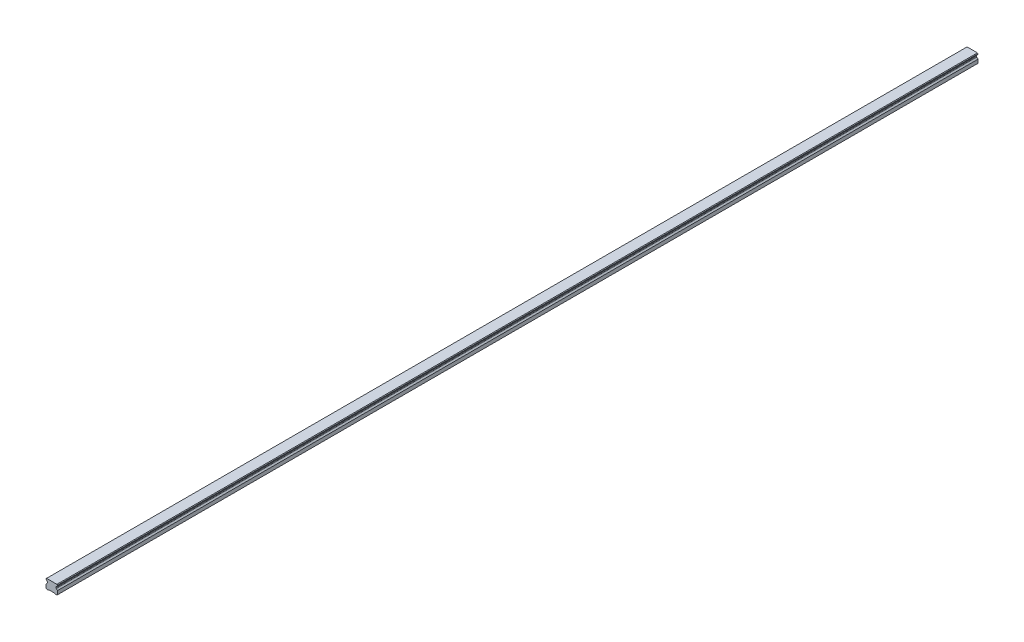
from build123d import *

# Parameters (mm, degrees)
SKETCH1_W           = 20
SKETCH1_H           = 16.3
BOSS_EXTRUDE1_DEPTH = 800
CUT_EXTRUDE1_DEPTH  = 1601.114274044
CHAMFER1_SIZE       = 1
FILLET1_R           = 1
CUT_EXTRUDE2_DEPTH  = 1601.114274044
SKETCH5_R           = 3
SKETCH5_R_2         = 2.5
CUT_EXTRUDE5_DEPTH  = 10
SKETCH5_2_R         = 2.5
CUT_EXTRUDE6_DEPTH  = 13
LPATTERN2_COUNT     = 27
LPATTERN2_PITCH     = 60


with BuildPart() as part:
    # Sketch1 → Boss-Extrude1 (new, symmetric)
    with BuildSketch(Plane.XY):
        with Locations((0, 8.15)):
            Rectangle(SKETCH1_W, SKETCH1_H)
    extrude(amount=BOSS_EXTRUDE1_DEPTH, both=True)

    # Sketch2 → Cut-Extrude1 (cut, through all)
    with BuildSketch(Plane.XY.offset(800)):
        Polygon((-10, 14.3), (-10, 7.3), (-7.666666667, 9.633333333), (-7.666666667, 11.966666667), align=None)
        Polygon((7.666666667, 11.966666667), (10, 14.3), (10, 7.3), (7.666666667, 9.633333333), align=None)
    extrude(amount=-CUT_EXTRUDE1_DEPTH, mode=Mode.SUBTRACT)

    # Chamfer1
    chamfer1_edges = [part.edges().sort_by_distance(p)[0] for p in [
        (-10, 16.3, 0),
        (10, 16.3, 0),
        (10, 0, 0),
        (-10, 0, 0),
    ]]
    chamfer(chamfer1_edges, length=CHAMFER1_SIZE)

    # Fillet1
    fillet1_edges = [part.edges().sort_by_distance(p)[0] for p in [
        (-7.666666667, 11.966666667, 0),
        (-7.666666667, 9.633333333, 0),
        (7.666666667, 9.633333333, 0),
        (7.666666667, 11.966666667, 0),
    ]]
    fillet(fillet1_edges, radius=FILLET1_R)

    # Sketch3 → Cut-Extrude2 (cut, through all)
    with BuildSketch(Plane.XY.offset(800)):
        Polygon((-6, 0), (-5, 1), (5, 1), (6, 0), align=None)
    extrude(amount=-CUT_EXTRUDE2_DEPTH, mode=Mode.SUBTRACT)

    # Sketch5 → Cut-Extrude5 (cut)
    with BuildSketch(Plane.XZ.offset(-1)):
        with Locations(Location((0, 780, 0), (0, 0, 270))):
            Circle(SKETCH5_R)
        with Locations(Location((0, 780, 0), (0, 0, 270))):
            Circle(SKETCH5_R_2, mode=Mode.SUBTRACT)
    cut_extrude5 = extrude(amount=-CUT_EXTRUDE5_DEPTH, mode=Mode.SUBTRACT)

    # Sketch5_2 → Cut-Extrude6 (cut)
    with BuildSketch(Plane.XZ.offset(-1)):
        with Locations(Location((0, 780, 0), (0, 0, 270))):
            Circle(SKETCH5_2_R)
    cut_extrude6 = extrude(amount=-CUT_EXTRUDE6_DEPTH, mode=Mode.SUBTRACT)

    # Cut-Extrude7 cone 1 section (on through the dimple's axis) → Cut-Extrude7 (revolve, cut)
    with BuildSketch(Plane(origin=(0, 14, 780), x_dir=(0, 0, -1), z_dir=(1, 0, 0))):
        Polygon((0, 0), (2.5, 0), (0, 1.443375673), align=None)
    cut_extrude7 = revolve(axis=Axis((0, 14, 780), (0, 1, 0)), mode=Mode.SUBTRACT)

    # LPattern2: Cut-Extrude5, Cut-Extrude6, Cut-Extrude7 ×27
    with Locations(*[(0, 0, -i * LPATTERN2_PITCH) for i in range(1, LPATTERN2_COUNT)]):
        add(cut_extrude5, mode=Mode.SUBTRACT)
        add(cut_extrude6, mode=Mode.SUBTRACT)
        add(cut_extrude7, mode=Mode.SUBTRACT)


solid = part.part
